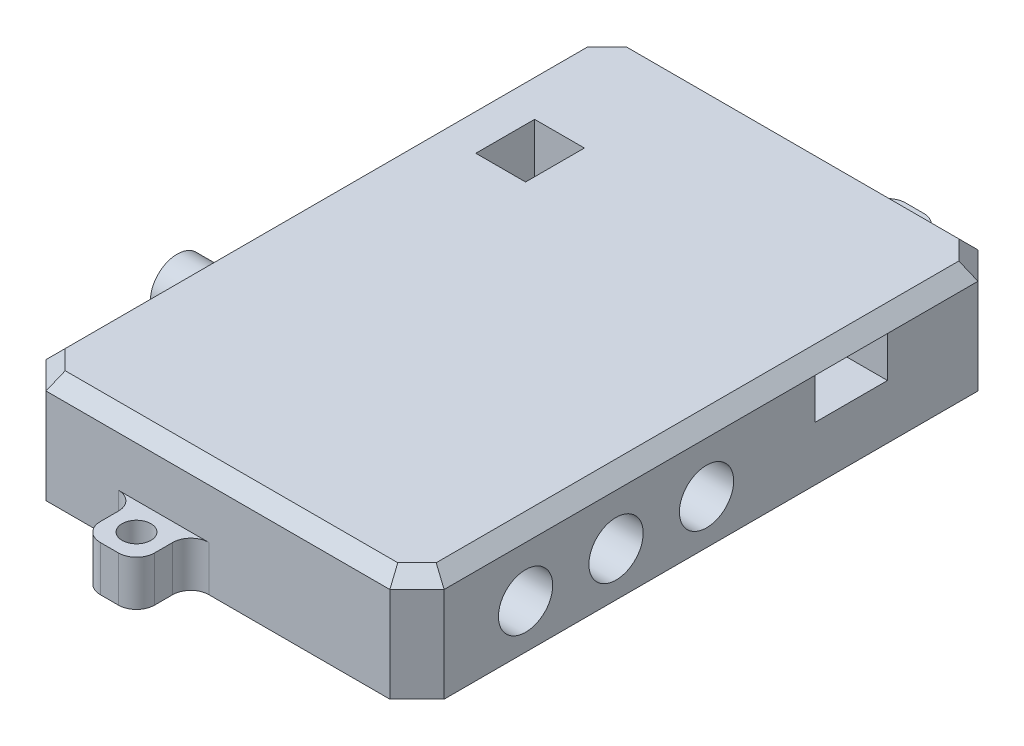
from build123d import *

# Parameters (mm, degrees)
SKETCH_1_W          = 44
SKETCH_1_H          = 65
EXTRUDE_1_DEPTH     = 12
CHAMFER_1_SIZE      = 3
CHAMFER_2_SIZE      = 1.5
SKETCH_2_W          = 6
SKETCH_2_H          = 6
SKETCH_2_R          = 1.6
EXTRUDE_2_DEPTH     = 5
FILLET_1_R          = 2
FILLET_2_R          = 2
SKETCH_3_R          = 3
CUT_EXTRUDE_1_DEPTH = 5
SKETCH_4_R          = 2.96404504
EXTRUDE_3_DEPTH     = 5
SKETCH_5_W          = 5.5
SKETCH_5_H          = 6.5
CUT_EXTRUDE_2_DEPTH = 49.53091798
SKETCH_6_W          = 8
SKETCH_6_H          = 4.5
CUT_EXTRUDE_3_DEPTH = 5


with BuildPart() as part:
    # Sketch 1 → Extrude 1 (new body)
    with BuildSketch(Plane(origin=(0, 0, 0), x_dir=(1, 0, 0), z_dir=(0, 1, 0))):
        Rectangle(SKETCH_1_W, SKETCH_1_H)
    extrude(amount=EXTRUDE_1_DEPTH)

    # Chamfer 1
    chamfer_1_edges = [part.edges().sort_by_distance(p)[0] for p in [
        (22, 6, 32.5),
        (-22, 6, 32.5),
        (-22, 6, -32.5),
        (22, 6, -32.5),
    ]]
    chamfer(chamfer_1_edges, length=CHAMFER_1_SIZE)

    # Chamfer 2
    chamfer_2_edges = [part.edges().sort_by_distance(p)[0] for p in [
        (-22, 12, 0),
        (0, 12, -32.5),
        (22, 12, 0),
        (0, 12, 32.5),
        (-20.5, 12, 31),
        (20.5, 12, 31),
        (20.5, 12, -31),
        (-20.5, 12, -31),
    ]]
    chamfer(chamfer_2_edges, length=CHAMFER_2_SIZE)

    # Sketch 2 → Extrude 2 (add)
    # profile 1 of 2: a face of its own
    with BuildSketch(Plane.XZ):
        with Locations((-6, 35.5)):
            Rectangle(SKETCH_2_W, SKETCH_2_H)
        with Locations(Location((-6, 35.5, 0), (0, 0, 270))):
            Circle(SKETCH_2_R, mode=Mode.SUBTRACT)
    # profile 2 of 2: a face of its own
    with BuildSketch(Plane.XZ):
        with Locations((6, -35.5)):
            Rectangle(SKETCH_2_W, SKETCH_2_H)
        with Locations(Location((6, -35.5, 0), (0, 0, 270))):
            Circle(SKETCH_2_R, mode=Mode.SUBTRACT)
    extrude(amount=-EXTRUDE_2_DEPTH)

    # Fillet 1
    fillet_1_edges = [part.edges().sort_by_distance(p)[0] for p in [
        (9, 2.5, -32.5),
        (3, 2.5, -32.5),
        (-3, 2.5, 32.5),
        (-9, 2.5, 32.5),
    ]]
    fillet(fillet_1_edges, radius=FILLET_1_R)

    # Fillet 2
    fillet_2_edges = [part.edges().sort_by_distance(p)[0] for p in [
        (9, 2.5, -38.5),
        (3, 2.5, -38.5),
        (-3, 2.5, 38.5),
        (-9, 2.5, 38.5),
    ]]
    fillet(fillet_2_edges, radius=FILLET_2_R)

    # Sketch 3 → Cut-Extrude 1 (cut)
    with BuildSketch(Plane(origin=(22, 0, 0), x_dir=(0, 0, -1), z_dir=(1, 0, 0))):
        with Locations((-20.5, 4.900714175)):
            Circle(SKETCH_3_R)
        with Locations((-10.5, 4.900714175)):
            Circle(SKETCH_3_R)
        with Locations((-0.5, 4.900714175)):
            Circle(SKETCH_3_R)
    extrude(amount=-CUT_EXTRUDE_1_DEPTH, mode=Mode.SUBTRACT)

    # Sketch 4 → Extrude 3 (add)
    with BuildSketch(Plane.ZY.offset(22)):
        with Locations(Location((10, 5.389285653, 0), (0, 0, 180))):
            Circle(SKETCH_4_R)
    extrude(amount=EXTRUDE_3_DEPTH)

    # Sketch 5 → Cut-Extrude 2 (cut, through all)
    with BuildSketch(Plane.XZ):
        with Locations((-13.75, -15.75)):
            Rectangle(SKETCH_5_W, SKETCH_5_H)
    extrude(amount=-CUT_EXTRUDE_2_DEPTH, mode=Mode.SUBTRACT)

    # Sketch 6 → Cut-Extrude 3 (cut)
    with BuildSketch(Plane(origin=(22, 0, 0), x_dir=(0, 0, -1), z_dir=(1, 0, 0))):
        with Locations((15.5, 8.25)):
            Rectangle(SKETCH_6_W, SKETCH_6_H)
    extrude(amount=-CUT_EXTRUDE_3_DEPTH, mode=Mode.SUBTRACT)


solid = part.part
